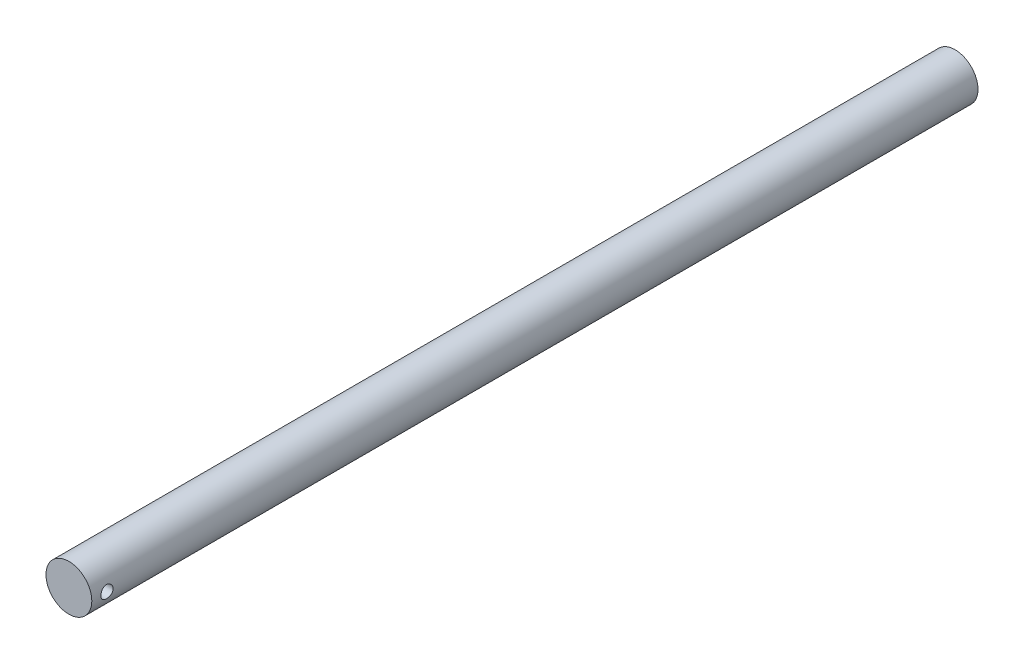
ISO-10303-21;
HEADER;
FILE_DESCRIPTION(('STEP AP214'),'2;1');
FILE_NAME('part.step','',(''),(''),'','','');
FILE_SCHEMA(('AUTOMOTIVE_DESIGN { 1 0 10303 214 1 1 1 1 }'));
ENDSEC;
DATA;
#1=APPLICATION_CONTEXT('core data for automotive mechanical design processes');
#2=APPLICATION_PROTOCOL_DEFINITION('international standard','automotive_design',2000,#1);
#3=PRODUCT_CONTEXT('',#1,'mechanical');
#4=PRODUCT('Part','Part','',(#3));
#5=PRODUCT_RELATED_PRODUCT_CATEGORY('part','',(#4));
#6=PRODUCT_DEFINITION_FORMATION('','',#4);
#7=PRODUCT_DEFINITION_CONTEXT('part definition',#1,'design');
#8=PRODUCT_DEFINITION('design','',#6,#7);
#9=PRODUCT_DEFINITION_SHAPE('','',#8);
#10=(LENGTH_UNIT() NAMED_UNIT(*) SI_UNIT(.MILLI.,.METRE.));
#11=(NAMED_UNIT(*) PLANE_ANGLE_UNIT() SI_UNIT($,.RADIAN.));
#12=(NAMED_UNIT(*) SI_UNIT($,.STERADIAN.) SOLID_ANGLE_UNIT());
#13=UNCERTAINTY_MEASURE_WITH_UNIT(LENGTH_MEASURE(1.E-05),#10,'distance_accuracy_value','');
#14=(GEOMETRIC_REPRESENTATION_CONTEXT(3) GLOBAL_UNCERTAINTY_ASSIGNED_CONTEXT((#13)) GLOBAL_UNIT_ASSIGNED_CONTEXT((#10,
#11,#12)) REPRESENTATION_CONTEXT('',''));
#15=CARTESIAN_POINT('',(0.,0.,0.));
#16=DIRECTION('',(0.,0.,1.));
#17=DIRECTION('',(1.,0.,0.));
#18=AXIS2_PLACEMENT_3D('',#15,#16,#17);
#19=CARTESIAN_POINT('',(0.,0.,29.));
#20=DIRECTION('',(0.,0.,-1.));
#21=DIRECTION('',(-1.,0.,0.));
#22=AXIS2_PLACEMENT_3D('',#19,#20,#21);
#23=CYLINDRICAL_SURFACE('',#22,0.75);
#24=CARTESIAN_POINT('',(-0.75,0.,28.7));
#25=CARTESIAN_POINT('',(-0.749999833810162,-0.0110254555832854,28.6999997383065));
#26=CARTESIAN_POINT('',(-0.749754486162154,-0.0220537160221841,28.699085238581));
#27=CARTESIAN_POINT('',(-0.748799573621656,-0.0437925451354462,28.6954578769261));
#28=CARTESIAN_POINT('',(-0.748089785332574,-0.0545029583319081,28.6927441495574));
#29=CARTESIAN_POINT('',(-0.746284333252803,-0.0752891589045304,28.6856128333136));
#30=CARTESIAN_POINT('',(-0.745189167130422,-0.0853657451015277,28.6811974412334));
#31=CARTESIAN_POINT('',(-0.742728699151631,-0.104635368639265,28.6707962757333));
#32=CARTESIAN_POINT('',(-0.741363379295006,-0.113828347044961,28.6648103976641));
#33=CARTESIAN_POINT('',(-0.738474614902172,-0.131282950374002,28.6512916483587));
#34=CARTESIAN_POINT('',(-0.73694846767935,-0.139521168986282,28.6437291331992));
#35=CARTESIAN_POINT('',(-0.733927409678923,-0.154628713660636,28.6273351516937));
#36=CARTESIAN_POINT('',(-0.732432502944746,-0.161497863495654,28.6185035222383));
#37=CARTESIAN_POINT('',(-0.729615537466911,-0.173786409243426,28.5996351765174));
#38=CARTESIAN_POINT('',(-0.728296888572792,-0.179178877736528,28.5895803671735));
#39=CARTESIAN_POINT('',(-0.726021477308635,-0.188187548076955,28.5686659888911));
#40=CARTESIAN_POINT('',(-0.7250646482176,-0.191804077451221,28.557806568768));
#41=CARTESIAN_POINT('',(-0.723649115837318,-0.197076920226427,28.5358504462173));
#42=CARTESIAN_POINT('',(-0.723179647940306,-0.198775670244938,28.5247646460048));
#43=CARTESIAN_POINT('',(-0.722759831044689,-0.200297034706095,28.5024562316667));
#44=CARTESIAN_POINT('',(-0.722809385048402,-0.200119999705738,28.4912336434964));
#45=CARTESIAN_POINT('',(-0.723412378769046,-0.197928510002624,28.4693014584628));
#46=CARTESIAN_POINT('',(-0.723951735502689,-0.195965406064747,28.4585862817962));
#47=CARTESIAN_POINT('',(-0.72545101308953,-0.190339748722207,28.4376431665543));
#48=CARTESIAN_POINT('',(-0.726410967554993,-0.186677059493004,28.4274152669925));
#49=CARTESIAN_POINT('',(-0.728655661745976,-0.177714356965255,28.4076031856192));
#50=CARTESIAN_POINT('',(-0.729943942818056,-0.172396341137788,28.3980275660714));
#51=CARTESIAN_POINT('',(-0.73269822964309,-0.160286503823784,28.3798865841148));
#52=CARTESIAN_POINT('',(-0.734164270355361,-0.153494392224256,28.3713214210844));
#53=CARTESIAN_POINT('',(-0.737167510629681,-0.138366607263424,28.3551511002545));
#54=CARTESIAN_POINT('',(-0.738705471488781,-0.129987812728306,28.3475863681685));
#55=CARTESIAN_POINT('',(-0.741636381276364,-0.112061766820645,28.333961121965));
#56=CARTESIAN_POINT('',(-0.743029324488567,-0.102514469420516,28.3279006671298));
#57=CARTESIAN_POINT('',(-0.74552182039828,-0.0824598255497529,28.3174382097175));
#58=CARTESIAN_POINT('',(-0.746620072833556,-0.0719484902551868,28.3130435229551));
#59=CARTESIAN_POINT('',(-0.748390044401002,-0.0503002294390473,28.3060952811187));
#60=CARTESIAN_POINT('',(-0.749061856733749,-0.0391634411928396,28.3035413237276));
#61=CARTESIAN_POINT('',(-0.749889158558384,-0.0169254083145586,28.3004105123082));
#62=CARTESIAN_POINT('',(-0.750058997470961,-0.00583242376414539,28.2997786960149));
#63=CARTESIAN_POINT('',(-0.749904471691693,0.0163010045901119,28.3003583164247));
#64=CARTESIAN_POINT('',(-0.749580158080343,0.0273414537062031,28.3015695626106));
#65=CARTESIAN_POINT('',(-0.748483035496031,0.0488602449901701,28.305755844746));
#66=CARTESIAN_POINT('',(-0.747718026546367,0.0593449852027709,28.3087002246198));
#67=CARTESIAN_POINT('',(-0.745826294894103,0.0796706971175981,28.3162335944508));
#68=CARTESIAN_POINT('',(-0.744699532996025,0.0895115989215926,28.320822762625));
#69=CARTESIAN_POINT('',(-0.742175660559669,0.108483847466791,28.3316173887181));
#70=CARTESIAN_POINT('',(-0.740773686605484,0.117597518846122,28.3378527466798));
#71=CARTESIAN_POINT('',(-0.737861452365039,0.134668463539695,28.3517251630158));
#72=CARTESIAN_POINT('',(-0.736351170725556,0.142625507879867,28.35936249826));
#73=CARTESIAN_POINT('',(-0.733339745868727,0.157388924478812,28.3760785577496));
#74=CARTESIAN_POINT('',(-0.731840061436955,0.164156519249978,28.38519185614));
#75=CARTESIAN_POINT('',(-0.729066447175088,0.176067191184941,28.4044564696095));
#76=CARTESIAN_POINT('',(-0.727792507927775,0.18121033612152,28.4146077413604));
#77=CARTESIAN_POINT('',(-0.725629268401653,0.18968741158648,28.4356095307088));
#78=CARTESIAN_POINT('',(-0.724737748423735,0.193031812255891,28.4464555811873));
#79=CARTESIAN_POINT('',(-0.723439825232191,0.197841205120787,28.4685839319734));
#80=CARTESIAN_POINT('',(-0.723033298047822,0.199306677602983,28.4798661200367));
#81=CARTESIAN_POINT('',(-0.722761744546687,0.200288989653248,28.5021494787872));
#82=CARTESIAN_POINT('',(-0.722879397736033,0.199868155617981,28.5131477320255));
#83=CARTESIAN_POINT('',(-0.723602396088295,0.197234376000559,28.5349103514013));
#84=CARTESIAN_POINT('',(-0.724207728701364,0.195021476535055,28.5456747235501));
#85=CARTESIAN_POINT('',(-0.72582757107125,0.188902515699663,28.5665855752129));
#86=CARTESIAN_POINT('',(-0.726838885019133,0.185009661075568,28.5767361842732));
#87=CARTESIAN_POINT('',(-0.729156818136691,0.175651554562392,28.5962478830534));
#88=CARTESIAN_POINT('',(-0.730463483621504,0.170186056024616,28.6056088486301));
#89=CARTESIAN_POINT('',(-0.733272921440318,0.157648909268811,28.6235730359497));
#90=CARTESIAN_POINT('',(-0.734780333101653,0.150534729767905,28.6321458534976));
#91=CARTESIAN_POINT('',(-0.737795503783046,0.134983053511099,28.6479962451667));
#92=CARTESIAN_POINT('',(-0.739303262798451,0.126545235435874,28.6552735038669));
#93=CARTESIAN_POINT('',(-0.742187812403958,0.108367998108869,28.6684792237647));
#94=CARTESIAN_POINT('',(-0.743561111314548,0.0986045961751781,28.6743755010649));
#95=CARTESIAN_POINT('',(-0.7459838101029,0.0781888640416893,28.6844337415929));
#96=CARTESIAN_POINT('',(-0.747033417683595,0.0675371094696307,28.6885968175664));
#97=CARTESIAN_POINT('',(-0.748554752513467,0.0474374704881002,28.6945275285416));
#98=CARTESIAN_POINT('',(-0.749092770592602,0.0380762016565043,28.6965749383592));
#99=CARTESIAN_POINT('',(-0.749815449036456,0.0191439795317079,28.6993112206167));
#100=CARTESIAN_POINT('',(-0.750000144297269,0.00957304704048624,28.70000022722));
#101=CARTESIAN_POINT('',(-0.75,0.,28.7));
#102=B_SPLINE_CURVE_WITH_KNOTS('',3,(#24,#25,#26,#27,#28,#29,#30,#31,#32,#33,#34,#35,#36,#37,
#38,#39,#40,#41,#42,#43,#44,#45,#46,#47,#48,#49,#50,#51,#52,#53,#54,#55,#56,#57,#58,#59,#60,#61,
#62,#63,#64,#65,#66,#67,#68,#69,#70,#71,#72,#73,#74,#75,#76,#77,#78,#79,#80,#81,#82,#83,#84,#85,
#86,#87,#88,#89,#90,#91,#92,#93,#94,#95,#96,#97,#98,#99,#100,#101),.UNSPECIFIED.,.T.,.F.,(4,2,2,
2,2,2,2,2,2,2,2,2,2,2,2,2,2,2,2,2,2,2,2,2,2,2,2,2,2,2,2,2,2,2,2,2,2,2,4),(0.,0.0330412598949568,
0.0660984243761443,0.0991130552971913,0.132129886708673,0.165834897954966,0.199544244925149,
0.233832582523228,0.268114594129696,0.301622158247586,0.33512346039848,0.367691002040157,
0.400261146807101,0.43319867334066,0.466142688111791,0.500161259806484,0.534181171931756,
0.568348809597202,0.6025089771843,0.635682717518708,0.66885302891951,0.701453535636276,
0.734057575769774,0.76730028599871,0.800549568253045,0.834736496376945,0.868921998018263,
0.90290629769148,0.936881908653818,0.969743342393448,1.00260393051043,1.03521076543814,
1.06782271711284,1.10139433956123,1.13497412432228,1.16927225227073,1.20354832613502,
1.23223981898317,1.26092847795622),.UNSPECIFIED.);
#103=CARTESIAN_POINT('',(-0.75,0.,28.7));
#104=VERTEX_POINT('',#103);
#105=EDGE_CURVE('E34',#104,#104,#102,.T.);
#106=ORIENTED_EDGE('',*,*,#105,.T.);
#107=EDGE_LOOP('',(#106));
#108=FACE_BOUND('',#107,.T.);
#109=CARTESIAN_POINT('',(0.75,0.,28.3));
#110=CARTESIAN_POINT('',(0.749999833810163,-0.011025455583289,28.3000002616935));
#111=CARTESIAN_POINT('',(0.749754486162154,-0.0220537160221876,28.300914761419));
#112=CARTESIAN_POINT('',(0.748799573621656,-0.0437925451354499,28.3045421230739));
#113=CARTESIAN_POINT('',(0.748089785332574,-0.0545029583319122,28.3072558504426));
#114=CARTESIAN_POINT('',(0.746284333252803,-0.0752891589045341,28.3143871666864));
#115=CARTESIAN_POINT('',(0.745189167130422,-0.0853657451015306,28.3188025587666));
#116=CARTESIAN_POINT('',(0.742728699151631,-0.104635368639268,28.3292037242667));
#117=CARTESIAN_POINT('',(0.741363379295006,-0.113828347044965,28.3351896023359));
#118=CARTESIAN_POINT('',(0.738474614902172,-0.131282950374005,28.3487083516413));
#119=CARTESIAN_POINT('',(0.73694846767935,-0.139521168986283,28.3562708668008));
#120=CARTESIAN_POINT('',(0.733927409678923,-0.154628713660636,28.3726648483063));
#121=CARTESIAN_POINT('',(0.732432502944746,-0.161497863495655,28.3814964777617));
#122=CARTESIAN_POINT('',(0.729615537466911,-0.173786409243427,28.4003648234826));
#123=CARTESIAN_POINT('',(0.728296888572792,-0.179178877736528,28.4104196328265));
#124=CARTESIAN_POINT('',(0.726021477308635,-0.188187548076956,28.4313340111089));
#125=CARTESIAN_POINT('',(0.7250646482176,-0.191804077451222,28.442193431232));
#126=CARTESIAN_POINT('',(0.723649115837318,-0.197076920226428,28.4641495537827));
#127=CARTESIAN_POINT('',(0.723179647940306,-0.198775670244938,28.4752353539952));
#128=CARTESIAN_POINT('',(0.722759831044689,-0.200297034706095,28.4975437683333));
#129=CARTESIAN_POINT('',(0.722809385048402,-0.200119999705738,28.5087663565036));
#130=CARTESIAN_POINT('',(0.723412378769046,-0.197928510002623,28.5306985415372));
#131=CARTESIAN_POINT('',(0.723951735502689,-0.195965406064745,28.5414137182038));
#132=CARTESIAN_POINT('',(0.72545101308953,-0.190339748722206,28.5623568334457));
#133=CARTESIAN_POINT('',(0.726410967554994,-0.186677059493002,28.5725847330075));
#134=CARTESIAN_POINT('',(0.728655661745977,-0.177714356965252,28.5923968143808));
#135=CARTESIAN_POINT('',(0.729943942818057,-0.172396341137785,28.6019724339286));
#136=CARTESIAN_POINT('',(0.732698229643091,-0.16028650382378,28.6201134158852));
#137=CARTESIAN_POINT('',(0.734164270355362,-0.153494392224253,28.6286785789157));
#138=CARTESIAN_POINT('',(0.737167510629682,-0.138366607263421,28.6448488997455));
#139=CARTESIAN_POINT('',(0.738705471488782,-0.129987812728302,28.6524136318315));
#140=CARTESIAN_POINT('',(0.741636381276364,-0.112061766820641,28.666038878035));
#141=CARTESIAN_POINT('',(0.743029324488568,-0.102514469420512,28.6720993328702));
#142=CARTESIAN_POINT('',(0.74552182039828,-0.0824598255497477,28.6825617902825));
#143=CARTESIAN_POINT('',(0.746620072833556,-0.0719484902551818,28.6869564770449));
#144=CARTESIAN_POINT('',(0.748390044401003,-0.0503002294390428,28.6939047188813));
#145=CARTESIAN_POINT('',(0.749061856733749,-0.0391634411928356,28.6964586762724));
#146=CARTESIAN_POINT('',(0.749889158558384,-0.0169254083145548,28.6995894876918));
#147=CARTESIAN_POINT('',(0.750058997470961,-0.0058324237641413,28.7002213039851));
#148=CARTESIAN_POINT('',(0.749904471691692,0.0163010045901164,28.6996416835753));
#149=CARTESIAN_POINT('',(0.749580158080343,0.0273414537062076,28.6984304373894));
#150=CARTESIAN_POINT('',(0.748483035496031,0.0488602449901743,28.694244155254));
#151=CARTESIAN_POINT('',(0.747718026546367,0.0593449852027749,28.6912997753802));
#152=CARTESIAN_POINT('',(0.745826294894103,0.0796706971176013,28.6837664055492));
#153=CARTESIAN_POINT('',(0.744699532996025,0.0895115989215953,28.679177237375));
#154=CARTESIAN_POINT('',(0.742175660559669,0.108483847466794,28.6683826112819));
#155=CARTESIAN_POINT('',(0.740773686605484,0.117597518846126,28.6621472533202));
#156=CARTESIAN_POINT('',(0.737861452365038,0.134668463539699,28.6482748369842));
#157=CARTESIAN_POINT('',(0.736351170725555,0.142625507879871,28.64063750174));
#158=CARTESIAN_POINT('',(0.733339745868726,0.157388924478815,28.6239214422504));
#159=CARTESIAN_POINT('',(0.731840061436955,0.164156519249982,28.61480814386));
#160=CARTESIAN_POINT('',(0.729066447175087,0.176067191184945,28.5955435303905));
#161=CARTESIAN_POINT('',(0.727792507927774,0.181210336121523,28.5853922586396));
#162=CARTESIAN_POINT('',(0.725629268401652,0.189687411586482,28.5643904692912));
#163=CARTESIAN_POINT('',(0.724737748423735,0.193031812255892,28.5535444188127));
#164=CARTESIAN_POINT('',(0.723439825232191,0.197841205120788,28.5314160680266));
#165=CARTESIAN_POINT('',(0.723033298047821,0.199306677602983,28.5201338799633));
#166=CARTESIAN_POINT('',(0.722761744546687,0.200288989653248,28.4978505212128));
#167=CARTESIAN_POINT('',(0.722879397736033,0.199868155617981,28.4868522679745));
#168=CARTESIAN_POINT('',(0.723602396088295,0.197234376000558,28.4650896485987));
#169=CARTESIAN_POINT('',(0.724207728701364,0.195021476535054,28.4543252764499));
#170=CARTESIAN_POINT('',(0.725827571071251,0.188902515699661,28.4334144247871));
#171=CARTESIAN_POINT('',(0.726838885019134,0.185009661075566,28.4232638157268));
#172=CARTESIAN_POINT('',(0.729156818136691,0.175651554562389,28.4037521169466));
#173=CARTESIAN_POINT('',(0.730463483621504,0.170186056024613,28.3943911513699));
#174=CARTESIAN_POINT('',(0.733272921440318,0.157648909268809,28.3764269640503));
#175=CARTESIAN_POINT('',(0.734780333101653,0.150534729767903,28.3678541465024));
#176=CARTESIAN_POINT('',(0.737795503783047,0.134983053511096,28.3520037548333));
#177=CARTESIAN_POINT('',(0.739303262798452,0.126545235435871,28.3447264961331));
#178=CARTESIAN_POINT('',(0.742187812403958,0.108367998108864,28.3315207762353));
#179=CARTESIAN_POINT('',(0.743561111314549,0.0986045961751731,28.3256244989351));
#180=CARTESIAN_POINT('',(0.745983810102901,0.0781888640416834,28.3155662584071));
#181=CARTESIAN_POINT('',(0.747033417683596,0.0675371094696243,28.3114031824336));
#182=CARTESIAN_POINT('',(0.748554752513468,0.0474374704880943,28.3054724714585));
#183=CARTESIAN_POINT('',(0.749092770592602,0.0380762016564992,28.3034250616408));
#184=CARTESIAN_POINT('',(0.749815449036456,0.0191439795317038,28.3006887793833));
#185=CARTESIAN_POINT('',(0.75000014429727,0.00957304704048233,28.29999977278));
#186=CARTESIAN_POINT('',(0.75,0.,28.3));
#187=B_SPLINE_CURVE_WITH_KNOTS('',3,(#109,#110,#111,#112,#113,#114,#115,#116,#117,#118,#119,
#120,#121,#122,#123,#124,#125,#126,#127,#128,#129,#130,#131,#132,#133,#134,#135,#136,#137,#138,
#139,#140,#141,#142,#143,#144,#145,#146,#147,#148,#149,#150,#151,#152,#153,#154,#155,#156,#157,
#158,#159,#160,#161,#162,#163,#164,#165,#166,#167,#168,#169,#170,#171,#172,#173,#174,#175,#176,
#177,#178,#179,#180,#181,#182,#183,#184,#185,#186),.UNSPECIFIED.,.T.,.F.,(4,2,2,2,2,2,2,2,2,2,2,
2,2,2,2,2,2,2,2,2,2,2,2,2,2,2,2,2,2,2,2,2,2,2,2,2,2,2,4),(0.,0.033041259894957,
0.0660984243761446,0.0991130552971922,0.132129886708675,0.165834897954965,0.199544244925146,
0.233832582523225,0.268114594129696,0.301622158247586,0.335123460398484,0.367691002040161,
0.400261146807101,0.433198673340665,0.466142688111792,0.500161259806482,0.534181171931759,
0.568348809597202,0.6025089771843,0.635682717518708,0.668853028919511,0.701453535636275,
0.734057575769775,0.767300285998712,0.800549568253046,0.834736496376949,0.868921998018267,
0.90290629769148,0.936881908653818,0.969743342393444,1.00260393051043,1.03521076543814,
1.06782271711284,1.10139433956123,1.13497412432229,1.16927225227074,1.20354832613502,
1.23223981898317,1.26092847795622),.UNSPECIFIED.);
#188=CARTESIAN_POINT('',(0.75,0.,28.3));
#189=VERTEX_POINT('',#188);
#190=EDGE_CURVE('E47',#189,#189,#187,.T.);
#191=ORIENTED_EDGE('',*,*,#190,.T.);
#192=EDGE_LOOP('',(#191));
#193=FACE_BOUND('',#192,.T.);
#194=CARTESIAN_POINT('',(0.,0.,29.));
#195=DIRECTION('',(0.,0.,1.));
#196=DIRECTION('',(1.,0.,0.));
#197=AXIS2_PLACEMENT_3D('',#194,#195,#196);
#198=CIRCLE('',#197,0.75);
#199=CARTESIAN_POINT('',(0.75,0.,29.));
#200=VERTEX_POINT('',#199);
#201=EDGE_CURVE('E10',#200,#200,#198,.T.);
#202=ORIENTED_EDGE('',*,*,#201,.F.);
#203=EDGE_LOOP('',(#202));
#204=FACE_BOUND('',#203,.T.);
#205=CARTESIAN_POINT('',(0.,0.,0.));
#206=DIRECTION('',(0.,0.,1.));
#207=DIRECTION('',(1.,0.,0.));
#208=AXIS2_PLACEMENT_3D('',#205,#206,#207);
#209=CIRCLE('',#208,0.75);
#210=CARTESIAN_POINT('',(0.75,0.,0.));
#211=VERTEX_POINT('',#210);
#212=EDGE_CURVE('E41',#211,#211,#209,.T.);
#213=ORIENTED_EDGE('',*,*,#212,.T.);
#214=EDGE_LOOP('',(#213));
#215=FACE_BOUND('',#214,.T.);
#216=ADVANCED_FACE('F30',(#108,#193,#204,#215),#23,.T.);
#217=CARTESIAN_POINT('',(0.,0.,29.));
#218=DIRECTION('',(0.,0.,1.));
#219=DIRECTION('',(1.,0.,0.));
#220=AXIS2_PLACEMENT_3D('',#217,#218,#219);
#221=PLANE('',#220);
#222=ORIENTED_EDGE('',*,*,#201,.T.);
#223=EDGE_LOOP('',(#222));
#224=FACE_BOUND('',#223,.T.);
#225=ADVANCED_FACE('F59',(#224),#221,.T.);
#226=CARTESIAN_POINT('',(0.,0.,0.));
#227=DIRECTION('',(0.,0.,1.));
#228=DIRECTION('',(1.,0.,0.));
#229=AXIS2_PLACEMENT_3D('',#226,#227,#228);
#230=PLANE('',#229);
#231=ORIENTED_EDGE('',*,*,#212,.F.);
#232=EDGE_LOOP('',(#231));
#233=FACE_BOUND('',#232,.T.);
#234=ADVANCED_FACE('F55',(#233),#230,.F.);
#235=CARTESIAN_POINT('',(-1.,0.,28.5));
#236=DIRECTION('',(1.,0.,0.));
#237=DIRECTION('',(0.,0.,-1.));
#238=AXIS2_PLACEMENT_3D('',#235,#236,#237);
#239=CYLINDRICAL_SURFACE('',#238,0.199999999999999);
#240=ORIENTED_EDGE('',*,*,#190,.F.);
#241=EDGE_LOOP('',(#240));
#242=FACE_BOUND('',#241,.T.);
#243=ORIENTED_EDGE('',*,*,#105,.F.);
#244=EDGE_LOOP('',(#243));
#245=FACE_BOUND('',#244,.T.);
#246=ADVANCED_FACE('F51',(#242,#245),#239,.F.);
#247=CLOSED_SHELL('',(#216,#225,#234,#246));
#248=MANIFOLD_SOLID_BREP('B2',#247);
#249=ADVANCED_BREP_SHAPE_REPRESENTATION('',(#18,#248),#14);
#250=SHAPE_DEFINITION_REPRESENTATION(#9,#249);
ENDSEC;
END-ISO-10303-21;
